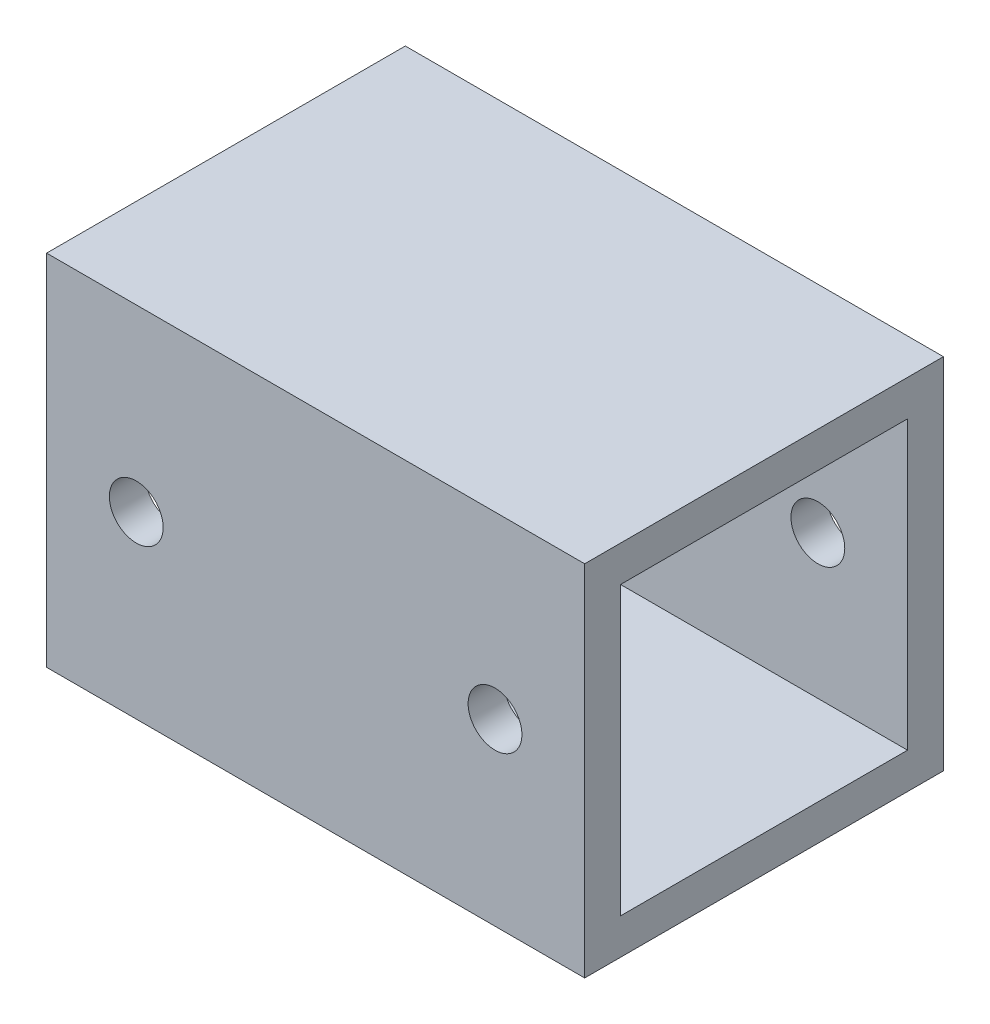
ISO-10303-21;
HEADER;
FILE_DESCRIPTION(('STEP AP214'),'2;1');
FILE_NAME('part.step','',(''),(''),'','','');
FILE_SCHEMA(('AUTOMOTIVE_DESIGN { 1 0 10303 214 1 1 1 1 }'));
ENDSEC;
DATA;
#1=APPLICATION_CONTEXT('core data for automotive mechanical design processes');
#2=APPLICATION_PROTOCOL_DEFINITION('international standard','automotive_design',2000,#1);
#3=PRODUCT_CONTEXT('',#1,'mechanical');
#4=PRODUCT('Part','Part','',(#3));
#5=PRODUCT_RELATED_PRODUCT_CATEGORY('part','',(#4));
#6=PRODUCT_DEFINITION_FORMATION('','',#4);
#7=PRODUCT_DEFINITION_CONTEXT('part definition',#1,'design');
#8=PRODUCT_DEFINITION('design','',#6,#7);
#9=PRODUCT_DEFINITION_SHAPE('','',#8);
#10=(LENGTH_UNIT() NAMED_UNIT(*) SI_UNIT(.MILLI.,.METRE.));
#11=(NAMED_UNIT(*) PLANE_ANGLE_UNIT() SI_UNIT($,.RADIAN.));
#12=(NAMED_UNIT(*) SI_UNIT($,.STERADIAN.) SOLID_ANGLE_UNIT());
#13=UNCERTAINTY_MEASURE_WITH_UNIT(LENGTH_MEASURE(1.E-05),#10,'distance_accuracy_value','');
#14=(GEOMETRIC_REPRESENTATION_CONTEXT(3) GLOBAL_UNCERTAINTY_ASSIGNED_CONTEXT((#13)) GLOBAL_UNIT_ASSIGNED_CONTEXT((#10,
#11,#12)) REPRESENTATION_CONTEXT('',''));
#15=CARTESIAN_POINT('',(0.,0.,0.));
#16=DIRECTION('',(0.,0.,1.));
#17=DIRECTION('',(1.,0.,0.));
#18=AXIS2_PLACEMENT_3D('',#15,#16,#17);
#19=CARTESIAN_POINT('',(30.,10.,-9.99999999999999));
#20=DIRECTION('',(-1.,0.,0.));
#21=DIRECTION('',(0.,0.,1.));
#22=AXIS2_PLACEMENT_3D('',#19,#20,#21);
#23=PLANE('',#22);
#24=DIRECTION('',(0.,1.,0.));
#25=VECTOR('',#24,1.);
#26=CARTESIAN_POINT('',(30.,-10.,-9.99999999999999));
#27=LINE('',#26,#25);
#28=CARTESIAN_POINT('',(30.,-10.,-9.99999999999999));
#29=VERTEX_POINT('',#28);
#30=CARTESIAN_POINT('',(30.,10.,-9.99999999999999));
#31=VERTEX_POINT('',#30);
#32=EDGE_CURVE('E136',#29,#31,#27,.T.);
#33=ORIENTED_EDGE('',*,*,#32,.T.);
#34=DIRECTION('',(0.,0.,1.));
#35=VECTOR('',#34,1.);
#36=CARTESIAN_POINT('',(30.,10.,10.));
#37=LINE('',#36,#35);
#38=CARTESIAN_POINT('',(30.,10.,10.));
#39=VERTEX_POINT('',#38);
#40=EDGE_CURVE('E139',#31,#39,#37,.T.);
#41=ORIENTED_EDGE('',*,*,#40,.T.);
#42=DIRECTION('',(0.,-1.,0.));
#43=VECTOR('',#42,1.);
#44=CARTESIAN_POINT('',(30.,-10.,10.));
#45=LINE('',#44,#43);
#46=CARTESIAN_POINT('',(30.,-10.,10.));
#47=VERTEX_POINT('',#46);
#48=EDGE_CURVE('E142',#39,#47,#45,.T.);
#49=ORIENTED_EDGE('',*,*,#48,.T.);
#50=DIRECTION('',(0.,0.,-1.));
#51=VECTOR('',#50,1.);
#52=CARTESIAN_POINT('',(30.,-10.,10.));
#53=LINE('',#52,#51);
#54=EDGE_CURVE('E144',#47,#29,#53,.T.);
#55=ORIENTED_EDGE('',*,*,#54,.T.);
#56=EDGE_LOOP('',(#33,#41,#49,#55));
#57=FACE_BOUND('',#56,.T.);
#58=DIRECTION('',(0.,1.,0.));
#59=VECTOR('',#58,1.);
#60=CARTESIAN_POINT('',(30.,-8.,-8.));
#61=LINE('',#60,#59);
#62=CARTESIAN_POINT('',(30.,-8.,-8.));
#63=VERTEX_POINT('',#62);
#64=CARTESIAN_POINT('',(30.,8.,-8.));
#65=VERTEX_POINT('',#64);
#66=EDGE_CURVE('E98',#63,#65,#61,.T.);
#67=ORIENTED_EDGE('',*,*,#66,.F.);
#68=DIRECTION('',(0.,0.,-1.));
#69=VECTOR('',#68,1.);
#70=CARTESIAN_POINT('',(30.,-8.,8.));
#71=LINE('',#70,#69);
#72=CARTESIAN_POINT('',(30.,-8.,8.));
#73=VERTEX_POINT('',#72);
#74=EDGE_CURVE('E120',#73,#63,#71,.T.);
#75=ORIENTED_EDGE('',*,*,#74,.F.);
#76=DIRECTION('',(0.,-1.,0.));
#77=VECTOR('',#76,1.);
#78=CARTESIAN_POINT('',(30.,-8.,8.));
#79=LINE('',#78,#77);
#80=CARTESIAN_POINT('',(30.,8.,8.));
#81=VERTEX_POINT('',#80);
#82=EDGE_CURVE('E118',#81,#73,#79,.T.);
#83=ORIENTED_EDGE('',*,*,#82,.F.);
#84=DIRECTION('',(0.,0.,1.));
#85=VECTOR('',#84,1.);
#86=CARTESIAN_POINT('',(30.,8.,8.));
#87=LINE('',#86,#85);
#88=EDGE_CURVE('E106',#65,#81,#87,.T.);
#89=ORIENTED_EDGE('',*,*,#88,.F.);
#90=EDGE_LOOP('',(#67,#75,#83,#89));
#91=FACE_BOUND('',#90,.T.);
#92=ADVANCED_FACE('F31',(#57,#91),#23,.F.);
#93=CARTESIAN_POINT('',(0.,10.,-9.99999999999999));
#94=DIRECTION('',(-1.,0.,0.));
#95=DIRECTION('',(0.,0.,1.));
#96=AXIS2_PLACEMENT_3D('',#93,#94,#95);
#97=PLANE('',#96);
#98=DIRECTION('',(0.,1.,0.));
#99=VECTOR('',#98,1.);
#100=CARTESIAN_POINT('',(0.,-10.,-9.99999999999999));
#101=LINE('',#100,#99);
#102=CARTESIAN_POINT('',(0.,-10.,-9.99999999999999));
#103=VERTEX_POINT('',#102);
#104=CARTESIAN_POINT('',(0.,10.,-9.99999999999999));
#105=VERTEX_POINT('',#104);
#106=EDGE_CURVE('E114',#103,#105,#101,.T.);
#107=ORIENTED_EDGE('',*,*,#106,.F.);
#108=DIRECTION('',(0.,0.,-1.));
#109=VECTOR('',#108,1.);
#110=CARTESIAN_POINT('',(0.,-10.,10.));
#111=LINE('',#110,#109);
#112=CARTESIAN_POINT('',(0.,-10.,10.));
#113=VERTEX_POINT('',#112);
#114=EDGE_CURVE('E140',#113,#103,#111,.T.);
#115=ORIENTED_EDGE('',*,*,#114,.F.);
#116=DIRECTION('',(0.,-1.,0.));
#117=VECTOR('',#116,1.);
#118=CARTESIAN_POINT('',(0.,-10.,10.));
#119=LINE('',#118,#117);
#120=CARTESIAN_POINT('',(0.,10.,10.));
#121=VERTEX_POINT('',#120);
#122=EDGE_CURVE('E151',#121,#113,#119,.T.);
#123=ORIENTED_EDGE('',*,*,#122,.F.);
#124=DIRECTION('',(0.,0.,1.));
#125=VECTOR('',#124,1.);
#126=CARTESIAN_POINT('',(0.,10.,10.));
#127=LINE('',#126,#125);
#128=EDGE_CURVE('E149',#105,#121,#127,.T.);
#129=ORIENTED_EDGE('',*,*,#128,.F.);
#130=EDGE_LOOP('',(#107,#115,#123,#129));
#131=FACE_BOUND('',#130,.T.);
#132=DIRECTION('',(0.,0.,-1.));
#133=VECTOR('',#132,1.);
#134=CARTESIAN_POINT('',(0.,-8.,8.));
#135=LINE('',#134,#133);
#136=CARTESIAN_POINT('',(0.,-8.,8.));
#137=VERTEX_POINT('',#136);
#138=CARTESIAN_POINT('',(0.,-8.,-8.));
#139=VERTEX_POINT('',#138);
#140=EDGE_CURVE('E107',#137,#139,#135,.T.);
#141=ORIENTED_EDGE('',*,*,#140,.T.);
#142=DIRECTION('',(0.,1.,0.));
#143=VECTOR('',#142,1.);
#144=CARTESIAN_POINT('',(0.,-8.,-8.));
#145=LINE('',#144,#143);
#146=CARTESIAN_POINT('',(0.,8.,-8.));
#147=VERTEX_POINT('',#146);
#148=EDGE_CURVE('E56',#139,#147,#145,.T.);
#149=ORIENTED_EDGE('',*,*,#148,.T.);
#150=DIRECTION('',(0.,0.,1.));
#151=VECTOR('',#150,1.);
#152=CARTESIAN_POINT('',(0.,8.,8.));
#153=LINE('',#152,#151);
#154=CARTESIAN_POINT('',(0.,8.,8.));
#155=VERTEX_POINT('',#154);
#156=EDGE_CURVE('E113',#147,#155,#153,.T.);
#157=ORIENTED_EDGE('',*,*,#156,.T.);
#158=DIRECTION('',(0.,-1.,0.));
#159=VECTOR('',#158,1.);
#160=CARTESIAN_POINT('',(0.,-8.,8.));
#161=LINE('',#160,#159);
#162=EDGE_CURVE('E128',#155,#137,#161,.T.);
#163=ORIENTED_EDGE('',*,*,#162,.T.);
#164=EDGE_LOOP('',(#141,#149,#157,#163));
#165=FACE_BOUND('',#164,.T.);
#166=ADVANCED_FACE('F198',(#131,#165),#97,.T.);
#167=CARTESIAN_POINT('',(30.,-10.,-9.99999999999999));
#168=DIRECTION('',(0.,0.,1.));
#169=DIRECTION('',(1.,0.,0.));
#170=AXIS2_PLACEMENT_3D('',#167,#168,#169);
#171=PLANE('',#170);
#172=CARTESIAN_POINT('',(25.,0.,-9.99999999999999));
#173=DIRECTION('',(0.,0.,1.));
#174=DIRECTION('',(1.,0.,0.));
#175=AXIS2_PLACEMENT_3D('',#172,#173,#174);
#176=CIRCLE('',#175,1.5);
#177=CARTESIAN_POINT('',(26.5,0.,-9.99999999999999));
#178=VERTEX_POINT('',#177);
#179=EDGE_CURVE('E180',#178,#178,#176,.T.);
#180=ORIENTED_EDGE('',*,*,#179,.T.);
#181=EDGE_LOOP('',(#180));
#182=FACE_BOUND('',#181,.T.);
#183=CARTESIAN_POINT('',(5.,0.,-9.99999999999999));
#184=DIRECTION('',(0.,0.,1.));
#185=DIRECTION('',(1.,0.,0.));
#186=AXIS2_PLACEMENT_3D('',#183,#184,#185);
#187=CIRCLE('',#186,1.5);
#188=CARTESIAN_POINT('',(6.5,0.,-9.99999999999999));
#189=VERTEX_POINT('',#188);
#190=EDGE_CURVE('E162',#189,#189,#187,.T.);
#191=ORIENTED_EDGE('',*,*,#190,.T.);
#192=EDGE_LOOP('',(#191));
#193=FACE_BOUND('',#192,.T.);
#194=ORIENTED_EDGE('',*,*,#106,.T.);
#195=DIRECTION('',(-1.,0.,0.));
#196=VECTOR('',#195,1.);
#197=CARTESIAN_POINT('',(30.,10.,-9.99999999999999));
#198=LINE('',#197,#196);
#199=EDGE_CURVE('E11',#31,#105,#198,.T.);
#200=ORIENTED_EDGE('',*,*,#199,.F.);
#201=ORIENTED_EDGE('',*,*,#32,.F.);
#202=DIRECTION('',(-1.,0.,0.));
#203=VECTOR('',#202,1.);
#204=CARTESIAN_POINT('',(30.,-10.,-9.99999999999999));
#205=LINE('',#204,#203);
#206=EDGE_CURVE('E146',#29,#103,#205,.T.);
#207=ORIENTED_EDGE('',*,*,#206,.T.);
#208=EDGE_LOOP('',(#194,#200,#201,#207));
#209=FACE_BOUND('',#208,.T.);
#210=ADVANCED_FACE('F33',(#182,#193,#209),#171,.F.);
#211=CARTESIAN_POINT('',(30.,10.,10.));
#212=DIRECTION('',(0.,-1.,0.));
#213=DIRECTION('',(0.,0.,-1.));
#214=AXIS2_PLACEMENT_3D('',#211,#212,#213);
#215=PLANE('',#214);
#216=ORIENTED_EDGE('',*,*,#128,.T.);
#217=DIRECTION('',(-1.,0.,0.));
#218=VECTOR('',#217,1.);
#219=CARTESIAN_POINT('',(30.,10.,10.));
#220=LINE('',#219,#218);
#221=EDGE_CURVE('E40',#39,#121,#220,.T.);
#222=ORIENTED_EDGE('',*,*,#221,.F.);
#223=ORIENTED_EDGE('',*,*,#40,.F.);
#224=ORIENTED_EDGE('',*,*,#199,.T.);
#225=EDGE_LOOP('',(#216,#222,#223,#224));
#226=FACE_BOUND('',#225,.T.);
#227=ADVANCED_FACE('F224',(#226),#215,.F.);
#228=CARTESIAN_POINT('',(30.,-10.,10.));
#229=DIRECTION('',(0.,0.,-1.));
#230=DIRECTION('',(-1.,0.,0.));
#231=AXIS2_PLACEMENT_3D('',#228,#229,#230);
#232=PLANE('',#231);
#233=CARTESIAN_POINT('',(25.,0.,10.));
#234=DIRECTION('',(0.,0.,1.));
#235=DIRECTION('',(1.,0.,0.));
#236=AXIS2_PLACEMENT_3D('',#233,#234,#235);
#237=CIRCLE('',#236,1.5);
#238=CARTESIAN_POINT('',(26.5,0.,10.));
#239=VERTEX_POINT('',#238);
#240=EDGE_CURVE('E177',#239,#239,#237,.T.);
#241=ORIENTED_EDGE('',*,*,#240,.F.);
#242=EDGE_LOOP('',(#241));
#243=FACE_BOUND('',#242,.T.);
#244=CARTESIAN_POINT('',(5.,0.,10.));
#245=DIRECTION('',(0.,0.,1.));
#246=DIRECTION('',(1.,0.,0.));
#247=AXIS2_PLACEMENT_3D('',#244,#245,#246);
#248=CIRCLE('',#247,1.5);
#249=CARTESIAN_POINT('',(6.5,0.,10.));
#250=VERTEX_POINT('',#249);
#251=EDGE_CURVE('E167',#250,#250,#248,.T.);
#252=ORIENTED_EDGE('',*,*,#251,.F.);
#253=EDGE_LOOP('',(#252));
#254=FACE_BOUND('',#253,.T.);
#255=ORIENTED_EDGE('',*,*,#122,.T.);
#256=DIRECTION('',(-1.,0.,0.));
#257=VECTOR('',#256,1.);
#258=CARTESIAN_POINT('',(30.,-10.,10.));
#259=LINE('',#258,#257);
#260=EDGE_CURVE('E156',#47,#113,#259,.T.);
#261=ORIENTED_EDGE('',*,*,#260,.F.);
#262=ORIENTED_EDGE('',*,*,#48,.F.);
#263=ORIENTED_EDGE('',*,*,#221,.T.);
#264=EDGE_LOOP('',(#255,#261,#262,#263));
#265=FACE_BOUND('',#264,.T.);
#266=ADVANCED_FACE('F221',(#243,#254,#265),#232,.F.);
#267=CARTESIAN_POINT('',(30.,-10.,10.));
#268=DIRECTION('',(0.,1.,0.));
#269=DIRECTION('',(0.,0.,1.));
#270=AXIS2_PLACEMENT_3D('',#267,#268,#269);
#271=PLANE('',#270);
#272=ORIENTED_EDGE('',*,*,#114,.T.);
#273=ORIENTED_EDGE('',*,*,#206,.F.);
#274=ORIENTED_EDGE('',*,*,#54,.F.);
#275=ORIENTED_EDGE('',*,*,#260,.T.);
#276=EDGE_LOOP('',(#272,#273,#274,#275));
#277=FACE_BOUND('',#276,.T.);
#278=ADVANCED_FACE('F218',(#277),#271,.F.);
#279=CARTESIAN_POINT('',(30.,-8.,-8.));
#280=DIRECTION('',(0.,0.,1.));
#281=DIRECTION('',(1.,0.,0.));
#282=AXIS2_PLACEMENT_3D('',#279,#280,#281);
#283=PLANE('',#282);
#284=CARTESIAN_POINT('',(25.,0.,-8.));
#285=DIRECTION('',(0.,0.,1.));
#286=DIRECTION('',(1.,0.,0.));
#287=AXIS2_PLACEMENT_3D('',#284,#285,#286);
#288=CIRCLE('',#287,1.5);
#289=CARTESIAN_POINT('',(26.5,0.,-8.));
#290=VERTEX_POINT('',#289);
#291=EDGE_CURVE('E172',#290,#290,#288,.T.);
#292=ORIENTED_EDGE('',*,*,#291,.F.);
#293=EDGE_LOOP('',(#292));
#294=FACE_BOUND('',#293,.T.);
#295=CARTESIAN_POINT('',(5.,0.,-8.));
#296=DIRECTION('',(0.,0.,1.));
#297=DIRECTION('',(1.,0.,0.));
#298=AXIS2_PLACEMENT_3D('',#295,#296,#297);
#299=CIRCLE('',#298,1.5);
#300=CARTESIAN_POINT('',(6.5,0.,-8.));
#301=VERTEX_POINT('',#300);
#302=EDGE_CURVE('E126',#301,#301,#299,.T.);
#303=ORIENTED_EDGE('',*,*,#302,.F.);
#304=EDGE_LOOP('',(#303));
#305=FACE_BOUND('',#304,.T.);
#306=ORIENTED_EDGE('',*,*,#148,.F.);
#307=DIRECTION('',(-1.,0.,0.));
#308=VECTOR('',#307,1.);
#309=CARTESIAN_POINT('',(30.,-8.,-8.));
#310=LINE('',#309,#308);
#311=EDGE_CURVE('E102',#63,#139,#310,.T.);
#312=ORIENTED_EDGE('',*,*,#311,.F.);
#313=ORIENTED_EDGE('',*,*,#66,.T.);
#314=DIRECTION('',(-1.,0.,0.));
#315=VECTOR('',#314,1.);
#316=CARTESIAN_POINT('',(30.,8.,-8.));
#317=LINE('',#316,#315);
#318=EDGE_CURVE('E101',#65,#147,#317,.T.);
#319=ORIENTED_EDGE('',*,*,#318,.T.);
#320=EDGE_LOOP('',(#306,#312,#313,#319));
#321=FACE_BOUND('',#320,.T.);
#322=ADVANCED_FACE('F100',(#294,#305,#321),#283,.T.);
#323=CARTESIAN_POINT('',(30.,8.,8.));
#324=DIRECTION('',(0.,-1.,0.));
#325=DIRECTION('',(0.,0.,-1.));
#326=AXIS2_PLACEMENT_3D('',#323,#324,#325);
#327=PLANE('',#326);
#328=ORIENTED_EDGE('',*,*,#156,.F.);
#329=ORIENTED_EDGE('',*,*,#318,.F.);
#330=ORIENTED_EDGE('',*,*,#88,.T.);
#331=DIRECTION('',(-1.,0.,0.));
#332=VECTOR('',#331,1.);
#333=CARTESIAN_POINT('',(30.,8.,8.));
#334=LINE('',#333,#332);
#335=EDGE_CURVE('E115',#81,#155,#334,.T.);
#336=ORIENTED_EDGE('',*,*,#335,.T.);
#337=EDGE_LOOP('',(#328,#329,#330,#336));
#338=FACE_BOUND('',#337,.T.);
#339=ADVANCED_FACE('F110',(#338),#327,.T.);
#340=CARTESIAN_POINT('',(30.,-8.,8.));
#341=DIRECTION('',(0.,0.,-1.));
#342=DIRECTION('',(-1.,0.,0.));
#343=AXIS2_PLACEMENT_3D('',#340,#341,#342);
#344=PLANE('',#343);
#345=CARTESIAN_POINT('',(25.,0.,8.));
#346=DIRECTION('',(0.,0.,-1.));
#347=DIRECTION('',(-1.,0.,0.));
#348=AXIS2_PLACEMENT_3D('',#345,#346,#347);
#349=CIRCLE('',#348,1.5);
#350=CARTESIAN_POINT('',(23.5,0.,8.));
#351=VERTEX_POINT('',#350);
#352=EDGE_CURVE('E35',#351,#351,#349,.T.);
#353=ORIENTED_EDGE('',*,*,#352,.F.);
#354=EDGE_LOOP('',(#353));
#355=FACE_BOUND('',#354,.T.);
#356=CARTESIAN_POINT('',(5.,0.,8.));
#357=DIRECTION('',(0.,0.,-1.));
#358=DIRECTION('',(-1.,0.,0.));
#359=AXIS2_PLACEMENT_3D('',#356,#357,#358);
#360=CIRCLE('',#359,1.5);
#361=CARTESIAN_POINT('',(3.5,0.,8.));
#362=VERTEX_POINT('',#361);
#363=EDGE_CURVE('E160',#362,#362,#360,.T.);
#364=ORIENTED_EDGE('',*,*,#363,.F.);
#365=EDGE_LOOP('',(#364));
#366=FACE_BOUND('',#365,.T.);
#367=ORIENTED_EDGE('',*,*,#162,.F.);
#368=ORIENTED_EDGE('',*,*,#335,.F.);
#369=ORIENTED_EDGE('',*,*,#82,.T.);
#370=DIRECTION('',(-1.,0.,0.));
#371=VECTOR('',#370,1.);
#372=CARTESIAN_POINT('',(30.,-8.,8.));
#373=LINE('',#372,#371);
#374=EDGE_CURVE('E48',#73,#137,#373,.T.);
#375=ORIENTED_EDGE('',*,*,#374,.T.);
#376=EDGE_LOOP('',(#367,#368,#369,#375));
#377=FACE_BOUND('',#376,.T.);
#378=ADVANCED_FACE('F190',(#355,#366,#377),#344,.T.);
#379=CARTESIAN_POINT('',(30.,-8.,8.));
#380=DIRECTION('',(0.,1.,0.));
#381=DIRECTION('',(0.,0.,1.));
#382=AXIS2_PLACEMENT_3D('',#379,#380,#381);
#383=PLANE('',#382);
#384=ORIENTED_EDGE('',*,*,#140,.F.);
#385=ORIENTED_EDGE('',*,*,#374,.F.);
#386=ORIENTED_EDGE('',*,*,#74,.T.);
#387=ORIENTED_EDGE('',*,*,#311,.T.);
#388=EDGE_LOOP('',(#384,#385,#386,#387));
#389=FACE_BOUND('',#388,.T.);
#390=ADVANCED_FACE('F193',(#389),#383,.T.);
#391=CARTESIAN_POINT('',(5.,0.,-9.99999999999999));
#392=DIRECTION('',(0.,0.,1.));
#393=DIRECTION('',(1.,0.,0.));
#394=AXIS2_PLACEMENT_3D('',#391,#392,#393);
#395=CYLINDRICAL_SURFACE('',#394,1.5);
#396=ORIENTED_EDGE('',*,*,#363,.T.);
#397=EDGE_LOOP('',(#396));
#398=FACE_BOUND('',#397,.T.);
#399=ORIENTED_EDGE('',*,*,#251,.T.);
#400=EDGE_LOOP('',(#399));
#401=FACE_BOUND('',#400,.T.);
#402=ADVANCED_FACE('F200',(#398,#401),#395,.F.);
#403=ORIENTED_EDGE('',*,*,#302,.T.);
#404=EDGE_LOOP('',(#403));
#405=FACE_BOUND('',#404,.T.);
#406=ORIENTED_EDGE('',*,*,#190,.F.);
#407=EDGE_LOOP('',(#406));
#408=FACE_BOUND('',#407,.T.);
#409=ADVANCED_FACE('F205',(#405,#408),#395,.F.);
#410=CARTESIAN_POINT('',(25.,0.,-9.99999999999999));
#411=DIRECTION('',(0.,0.,1.));
#412=DIRECTION('',(1.,0.,0.));
#413=AXIS2_PLACEMENT_3D('',#410,#411,#412);
#414=CYLINDRICAL_SURFACE('',#413,1.5);
#415=ORIENTED_EDGE('',*,*,#352,.T.);
#416=EDGE_LOOP('',(#415));
#417=FACE_BOUND('',#416,.T.);
#418=ORIENTED_EDGE('',*,*,#240,.T.);
#419=EDGE_LOOP('',(#418));
#420=FACE_BOUND('',#419,.T.);
#421=ADVANCED_FACE('F187',(#417,#420),#414,.F.);
#422=ORIENTED_EDGE('',*,*,#291,.T.);
#423=EDGE_LOOP('',(#422));
#424=FACE_BOUND('',#423,.T.);
#425=ORIENTED_EDGE('',*,*,#179,.F.);
#426=EDGE_LOOP('',(#425));
#427=FACE_BOUND('',#426,.T.);
#428=ADVANCED_FACE('F300',(#424,#427),#414,.F.);
#429=CLOSED_SHELL('',(#92,#166,#210,#227,#266,#278,#322,#339,#378,#390,#402,#409,#421,#428));
#430=MANIFOLD_SOLID_BREP('B2',#429);
#431=ADVANCED_BREP_SHAPE_REPRESENTATION('',(#18,#430),#14);
#432=SHAPE_DEFINITION_REPRESENTATION(#9,#431);
ENDSEC;
END-ISO-10303-21;
